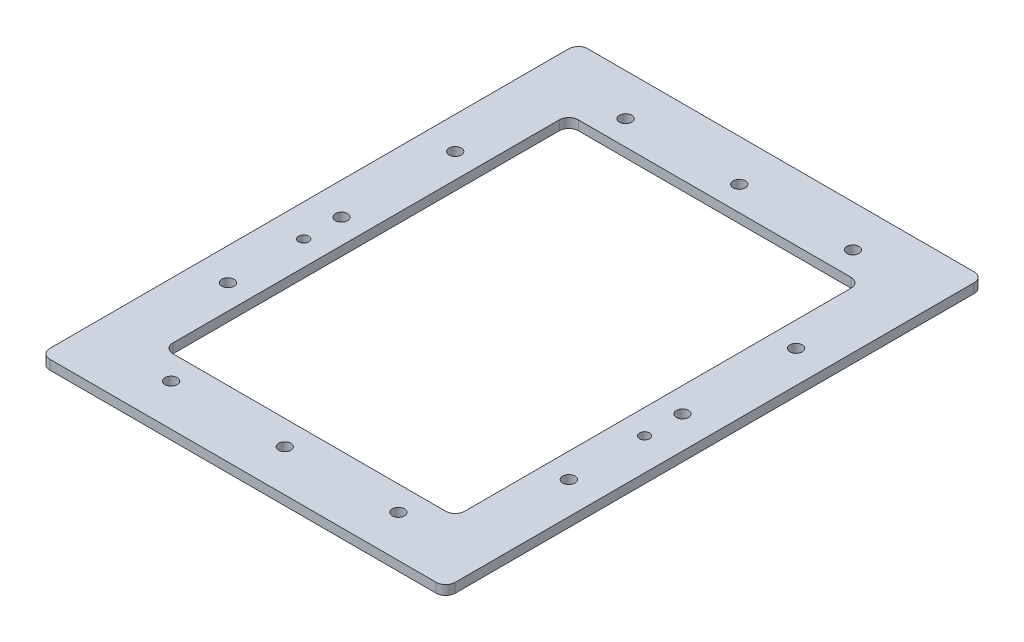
from build123d import *

# Parameters (mm, degrees)
SKETCH1_W                = 271.78
SKETCH1_H                = 360.68
SKETCH1_W_2              = 195.58
SKETCH1_H_2              = 271.78
BOSS_EXTRUDE1_DEPTH      = 6.35
FILLET1_R                = 6.35
F_5_16_CLEARANCE_HOLE1_D = 8.2042
F_1_4_CLEARANCE_HOLE1_D  = 6.7564


with BuildPart() as part:
    # Sketch1 → Boss-Extrude1 (new body)
    with BuildSketch(Plane(origin=(0, 0, 0), x_dir=(1, 0, 0), z_dir=(0, 1, 0))):
        Rectangle(SKETCH1_W, SKETCH1_H)
        Rectangle(SKETCH1_W_2, SKETCH1_H_2, mode=Mode.SUBTRACT)
    extrude(amount=-BOSS_EXTRUDE1_DEPTH)

    # Fillet1
    fillet1_edges = [part.edges().sort_by_distance(p)[0] for p in [
        (97.79, -3.175, -135.89),
        (97.79, -3.175, 135.89),
        (-97.79, -3.175, 135.89),
        (-97.79, -3.175, -135.89),
        (135.89, -3.175, 180.34),
        (-135.89, -3.175, 180.34),
        (-135.89, -3.175, -180.34),
        (135.89, -3.175, -180.34),
    ]]
    fillet(fillet1_edges, radius=FILLET1_R)

    # 5_16 Clearance Hole1 (through all)
    with Locations(Plane(origin=(0, 0, 0), x_dir=(1, 0, 0), z_dir=(0, 1, 0))):
        with Locations((-76.2, 152.4), (76.2, 152.4), (0, 152.4), (114.3, 0), (114.3, 76.2), (114.3, -76.2), (-114.3, 0), (-114.3, 76.2), (-114.3, -76.2), (0, -152.4), (-76.2, -152.4), (76.2, -152.4)):
            Hole(F_5_16_CLEARANCE_HOLE1_D / 2)

    # 1_4 Clearance Hole1 (through all)
    with Locations(Plane(origin=(0, 0, 0), x_dir=(1, 0, 0), z_dir=(0, 1, 0))):
        with Locations((-114.3, -25.4), (114.3, -25.4)):
            Hole(F_1_4_CLEARANCE_HOLE1_D / 2)


solid = part.part
